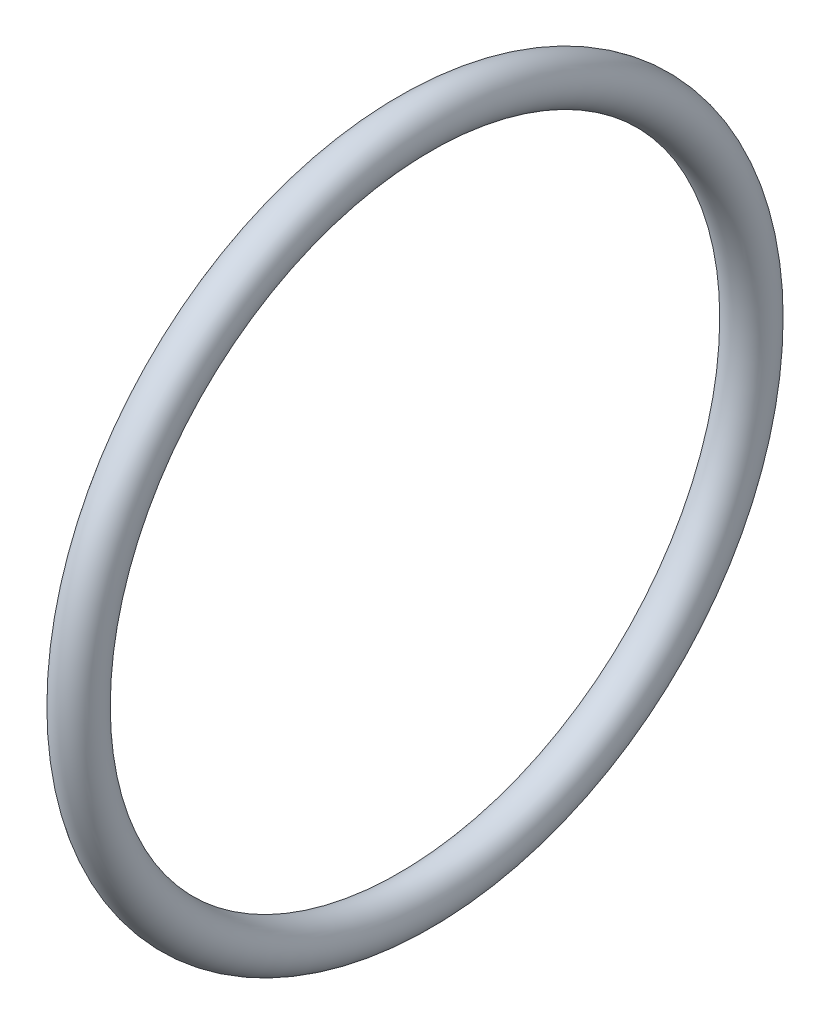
ISO-10303-21;
HEADER;
FILE_DESCRIPTION(('STEP AP214'),'2;1');
FILE_NAME('part.step','',(''),(''),'','','');
FILE_SCHEMA(('AUTOMOTIVE_DESIGN { 1 0 10303 214 1 1 1 1 }'));
ENDSEC;
DATA;
#1=APPLICATION_CONTEXT('core data for automotive mechanical design processes');
#2=APPLICATION_PROTOCOL_DEFINITION('international standard','automotive_design',2000,#1);
#3=PRODUCT_CONTEXT('',#1,'mechanical');
#4=PRODUCT('Part','Part','',(#3));
#5=PRODUCT_RELATED_PRODUCT_CATEGORY('part','',(#4));
#6=PRODUCT_DEFINITION_FORMATION('','',#4);
#7=PRODUCT_DEFINITION_CONTEXT('part definition',#1,'design');
#8=PRODUCT_DEFINITION('design','',#6,#7);
#9=PRODUCT_DEFINITION_SHAPE('','',#8);
#10=(LENGTH_UNIT() NAMED_UNIT(*) SI_UNIT(.MILLI.,.METRE.));
#11=(NAMED_UNIT(*) PLANE_ANGLE_UNIT() SI_UNIT($,.RADIAN.));
#12=(NAMED_UNIT(*) SI_UNIT($,.STERADIAN.) SOLID_ANGLE_UNIT());
#13=UNCERTAINTY_MEASURE_WITH_UNIT(LENGTH_MEASURE(1.E-05),#10,'distance_accuracy_value','');
#14=(GEOMETRIC_REPRESENTATION_CONTEXT(3) GLOBAL_UNCERTAINTY_ASSIGNED_CONTEXT((#13)) GLOBAL_UNIT_ASSIGNED_CONTEXT((#10,
#11,#12)) REPRESENTATION_CONTEXT('',''));
#15=CARTESIAN_POINT('',(0.,0.,0.));
#16=DIRECTION('',(0.,0.,1.));
#17=DIRECTION('',(1.,0.,0.));
#18=AXIS2_PLACEMENT_3D('',#15,#16,#17);
#19=CARTESIAN_POINT('',(0.,0.,0.));
#20=DIRECTION('',(-1.,0.,0.));
#21=DIRECTION('',(0.,0.,1.));
#22=AXIS2_PLACEMENT_3D('',#19,#20,#21);
#23=TOROIDAL_SURFACE('',#22,15.,1.);
#24=CARTESIAN_POINT('',(0.,0.,16.));
#25=VERTEX_POINT('',#24);
#26=VERTEX_LOOP('',#25);
#27=FACE_BOUND('',#26,.T.);
#28=ADVANCED_FACE('F344',(#27),#23,.T.);
#29=CLOSED_SHELL('',(#28));
#30=MANIFOLD_SOLID_BREP('B2',#29);
#31=ADVANCED_BREP_SHAPE_REPRESENTATION('',(#18,#30),#14);
#32=SHAPE_DEFINITION_REPRESENTATION(#9,#31);
ENDSEC;
END-ISO-10303-21;
